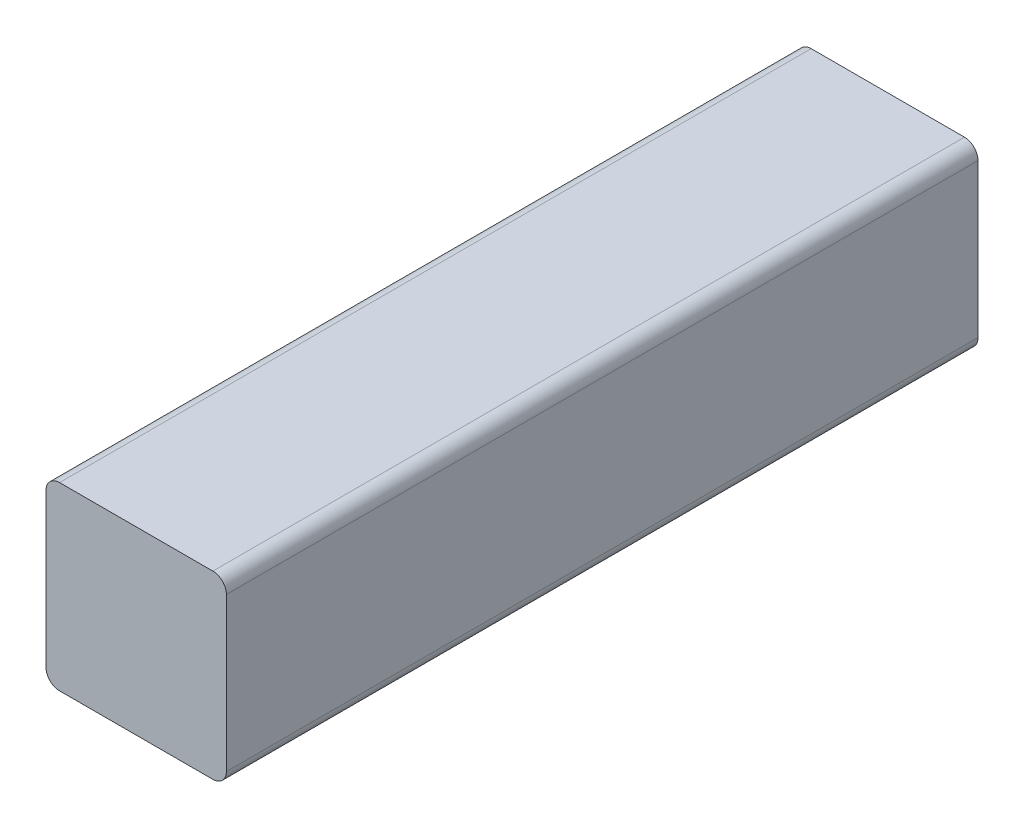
from build123d import *

# Parameters (mm, degrees)
EXTRUSION1_DEPTH = 125


with BuildPart() as part:
    # Esquisse1 → Extrusion1 (new body)
    with BuildSketch(Plane.XY):
        with BuildLine():
            Line((-15, 12.75), (-15, -12.75))
            ThreePointArc((-15, -12.75), (-14.340990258, -14.340990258), (-12.75, -15))
            Line((-12.75, -15), (12.75, -15))
            ThreePointArc((12.75, -15), (14.340990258, -14.340990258), (15, -12.75))
            Line((15, -12.75), (15, 12.75))
            ThreePointArc((15, 12.75), (14.340990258, 14.340990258), (12.75, 15))
            Line((12.75, 15), (-12.75, 15))
            ThreePointArc((-12.75, 15), (-14.340990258, 14.340990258), (-15, 12.75))
        make_face()
    extrude(amount=EXTRUSION1_DEPTH)


solid = part.part
